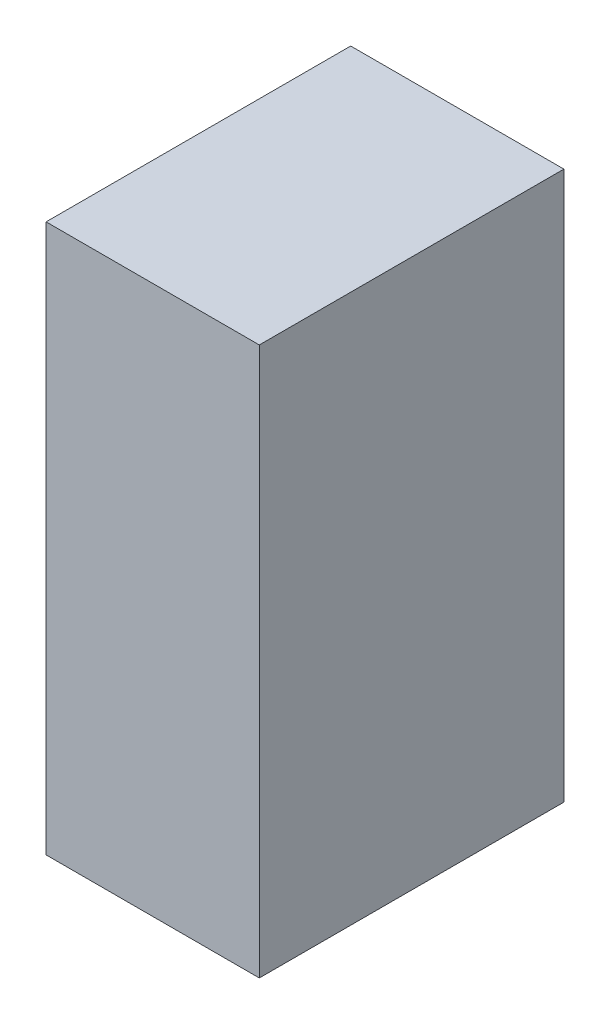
ISO-10303-21;
HEADER;
FILE_DESCRIPTION(('STEP AP214'),'2;1');
FILE_NAME('part.step','',(''),(''),'','','');
FILE_SCHEMA(('AUTOMOTIVE_DESIGN { 1 0 10303 214 1 1 1 1 }'));
ENDSEC;
DATA;
#1=APPLICATION_CONTEXT('core data for automotive mechanical design processes');
#2=APPLICATION_PROTOCOL_DEFINITION('international standard','automotive_design',2000,#1);
#3=PRODUCT_CONTEXT('',#1,'mechanical');
#4=PRODUCT('Part','Part','',(#3));
#5=PRODUCT_RELATED_PRODUCT_CATEGORY('part','',(#4));
#6=PRODUCT_DEFINITION_FORMATION('','',#4);
#7=PRODUCT_DEFINITION_CONTEXT('part definition',#1,'design');
#8=PRODUCT_DEFINITION('design','',#6,#7);
#9=PRODUCT_DEFINITION_SHAPE('','',#8);
#10=(LENGTH_UNIT() NAMED_UNIT(*) SI_UNIT(.MILLI.,.METRE.));
#11=(NAMED_UNIT(*) PLANE_ANGLE_UNIT() SI_UNIT($,.RADIAN.));
#12=(NAMED_UNIT(*) SI_UNIT($,.STERADIAN.) SOLID_ANGLE_UNIT());
#13=UNCERTAINTY_MEASURE_WITH_UNIT(LENGTH_MEASURE(1.E-05),#10,'distance_accuracy_value','');
#14=(GEOMETRIC_REPRESENTATION_CONTEXT(3) GLOBAL_UNCERTAINTY_ASSIGNED_CONTEXT((#13)) GLOBAL_UNIT_ASSIGNED_CONTEXT((#10,
#11,#12)) REPRESENTATION_CONTEXT('',''));
#15=CARTESIAN_POINT('',(0.,0.,0.));
#16=DIRECTION('',(0.,0.,1.));
#17=DIRECTION('',(1.,0.,0.));
#18=AXIS2_PLACEMENT_3D('',#15,#16,#17);
#19=CARTESIAN_POINT('',(-700.,700.,2000.));
#20=DIRECTION('',(1.,0.,0.));
#21=DIRECTION('',(0.,0.,-1.));
#22=AXIS2_PLACEMENT_3D('',#19,#20,#21);
#23=PLANE('',#22);
#24=DIRECTION('',(0.,-1.,0.));
#25=VECTOR('',#24,1.);
#26=CARTESIAN_POINT('',(-700.,700.,0.));
#27=LINE('',#26,#25);
#28=CARTESIAN_POINT('',(-700.,4300.,0.));
#29=VERTEX_POINT('',#28);
#30=CARTESIAN_POINT('',(-700.,700.,0.));
#31=VERTEX_POINT('',#30);
#32=EDGE_CURVE('E105',#29,#31,#27,.T.);
#33=ORIENTED_EDGE('',*,*,#32,.T.);
#34=DIRECTION('',(0.,0.,-1.));
#35=VECTOR('',#34,1.);
#36=CARTESIAN_POINT('',(-700.,700.,2000.));
#37=LINE('',#36,#35);
#38=CARTESIAN_POINT('',(-700.,700.,2000.));
#39=VERTEX_POINT('',#38);
#40=EDGE_CURVE('E11',#39,#31,#37,.T.);
#41=ORIENTED_EDGE('',*,*,#40,.F.);
#42=DIRECTION('',(0.,-1.,0.));
#43=VECTOR('',#42,1.);
#44=CARTESIAN_POINT('',(-700.,700.,2000.));
#45=LINE('',#44,#43);
#46=CARTESIAN_POINT('',(-700.,4300.,2000.));
#47=VERTEX_POINT('',#46);
#48=EDGE_CURVE('E89',#47,#39,#45,.T.);
#49=ORIENTED_EDGE('',*,*,#48,.F.);
#50=DIRECTION('',(0.,0.,-1.));
#51=VECTOR('',#50,1.);
#52=CARTESIAN_POINT('',(-700.,4300.,2000.));
#53=LINE('',#52,#51);
#54=EDGE_CURVE('E98',#47,#29,#53,.T.);
#55=ORIENTED_EDGE('',*,*,#54,.T.);
#56=EDGE_LOOP('',(#33,#41,#49,#55));
#57=FACE_BOUND('',#56,.T.);
#58=ADVANCED_FACE('F39',(#57),#23,.F.);
#59=CARTESIAN_POINT('',(-700.,700.,2000.));
#60=DIRECTION('',(0.,1.,0.));
#61=DIRECTION('',(0.,0.,1.));
#62=AXIS2_PLACEMENT_3D('',#59,#60,#61);
#63=PLANE('',#62);
#64=DIRECTION('',(1.,0.,0.));
#65=VECTOR('',#64,1.);
#66=CARTESIAN_POINT('',(-700.,700.,0.));
#67=LINE('',#66,#65);
#68=CARTESIAN_POINT('',(700.,700.,0.));
#69=VERTEX_POINT('',#68);
#70=EDGE_CURVE('E94',#31,#69,#67,.T.);
#71=ORIENTED_EDGE('',*,*,#70,.T.);
#72=DIRECTION('',(0.,0.,-1.));
#73=VECTOR('',#72,1.);
#74=CARTESIAN_POINT('',(700.,700.,2000.));
#75=LINE('',#74,#73);
#76=CARTESIAN_POINT('',(700.,700.,2000.));
#77=VERTEX_POINT('',#76);
#78=EDGE_CURVE('E50',#77,#69,#75,.T.);
#79=ORIENTED_EDGE('',*,*,#78,.F.);
#80=DIRECTION('',(1.,0.,0.));
#81=VECTOR('',#80,1.);
#82=CARTESIAN_POINT('',(-700.,700.,2000.));
#83=LINE('',#82,#81);
#84=EDGE_CURVE('E85',#39,#77,#83,.T.);
#85=ORIENTED_EDGE('',*,*,#84,.F.);
#86=ORIENTED_EDGE('',*,*,#40,.T.);
#87=EDGE_LOOP('',(#71,#79,#85,#86));
#88=FACE_BOUND('',#87,.T.);
#89=ADVANCED_FACE('F91',(#88),#63,.F.);
#90=CARTESIAN_POINT('',(700.,700.,2000.));
#91=DIRECTION('',(-1.,0.,0.));
#92=DIRECTION('',(0.,0.,1.));
#93=AXIS2_PLACEMENT_3D('',#90,#91,#92);
#94=PLANE('',#93);
#95=DIRECTION('',(0.,1.,0.));
#96=VECTOR('',#95,1.);
#97=CARTESIAN_POINT('',(700.,700.,0.));
#98=LINE('',#97,#96);
#99=CARTESIAN_POINT('',(700.,4300.,0.));
#100=VERTEX_POINT('',#99);
#101=EDGE_CURVE('E75',#69,#100,#98,.T.);
#102=ORIENTED_EDGE('',*,*,#101,.T.);
#103=DIRECTION('',(0.,0.,-1.));
#104=VECTOR('',#103,1.);
#105=CARTESIAN_POINT('',(700.,4300.,2000.));
#106=LINE('',#105,#104);
#107=CARTESIAN_POINT('',(700.,4300.,2000.));
#108=VERTEX_POINT('',#107);
#109=EDGE_CURVE('E92',#108,#100,#106,.T.);
#110=ORIENTED_EDGE('',*,*,#109,.F.);
#111=DIRECTION('',(0.,1.,0.));
#112=VECTOR('',#111,1.);
#113=CARTESIAN_POINT('',(700.,700.,2000.));
#114=LINE('',#113,#112);
#115=EDGE_CURVE('E86',#77,#108,#114,.T.);
#116=ORIENTED_EDGE('',*,*,#115,.F.);
#117=ORIENTED_EDGE('',*,*,#78,.T.);
#118=EDGE_LOOP('',(#102,#110,#116,#117));
#119=FACE_BOUND('',#118,.T.);
#120=ADVANCED_FACE('F96',(#119),#94,.F.);
#121=CARTESIAN_POINT('',(-700.,4300.,2000.));
#122=DIRECTION('',(0.,-1.,0.));
#123=DIRECTION('',(0.,0.,-1.));
#124=AXIS2_PLACEMENT_3D('',#121,#122,#123);
#125=PLANE('',#124);
#126=DIRECTION('',(-1.,0.,0.));
#127=VECTOR('',#126,1.);
#128=CARTESIAN_POINT('',(-700.,4300.,0.));
#129=LINE('',#128,#127);
#130=EDGE_CURVE('E79',#100,#29,#129,.T.);
#131=ORIENTED_EDGE('',*,*,#130,.T.);
#132=ORIENTED_EDGE('',*,*,#54,.F.);
#133=DIRECTION('',(-1.,0.,0.));
#134=VECTOR('',#133,1.);
#135=CARTESIAN_POINT('',(-700.,4300.,2000.));
#136=LINE('',#135,#134);
#137=EDGE_CURVE('E54',#108,#47,#136,.T.);
#138=ORIENTED_EDGE('',*,*,#137,.F.);
#139=ORIENTED_EDGE('',*,*,#109,.T.);
#140=EDGE_LOOP('',(#131,#132,#138,#139));
#141=FACE_BOUND('',#140,.T.);
#142=ADVANCED_FACE('F108',(#141),#125,.F.);
#143=CARTESIAN_POINT('',(0.,0.,2000.));
#144=DIRECTION('',(0.,0.,-1.));
#145=DIRECTION('',(-1.,0.,0.));
#146=AXIS2_PLACEMENT_3D('',#143,#144,#145);
#147=PLANE('',#146);
#148=ORIENTED_EDGE('',*,*,#48,.T.);
#149=ORIENTED_EDGE('',*,*,#84,.T.);
#150=ORIENTED_EDGE('',*,*,#115,.T.);
#151=ORIENTED_EDGE('',*,*,#137,.T.);
#152=EDGE_LOOP('',(#148,#149,#150,#151));
#153=FACE_BOUND('',#152,.T.);
#154=ADVANCED_FACE('F88',(#153),#147,.F.);
#155=CARTESIAN_POINT('',(0.,0.,0.));
#156=DIRECTION('',(0.,0.,-1.));
#157=DIRECTION('',(-1.,0.,0.));
#158=AXIS2_PLACEMENT_3D('',#155,#156,#157);
#159=PLANE('',#158);
#160=ORIENTED_EDGE('',*,*,#32,.F.);
#161=ORIENTED_EDGE('',*,*,#130,.F.);
#162=ORIENTED_EDGE('',*,*,#101,.F.);
#163=ORIENTED_EDGE('',*,*,#70,.F.);
#164=EDGE_LOOP('',(#160,#161,#162,#163));
#165=FACE_BOUND('',#164,.T.);
#166=ADVANCED_FACE('F115',(#165),#159,.T.);
#167=CLOSED_SHELL('',(#58,#89,#120,#142,#154,#166));
#168=MANIFOLD_SOLID_BREP('B2',#167);
#169=ADVANCED_BREP_SHAPE_REPRESENTATION('',(#18,#168),#14);
#170=SHAPE_DEFINITION_REPRESENTATION(#9,#169);
ENDSEC;
END-ISO-10303-21;
